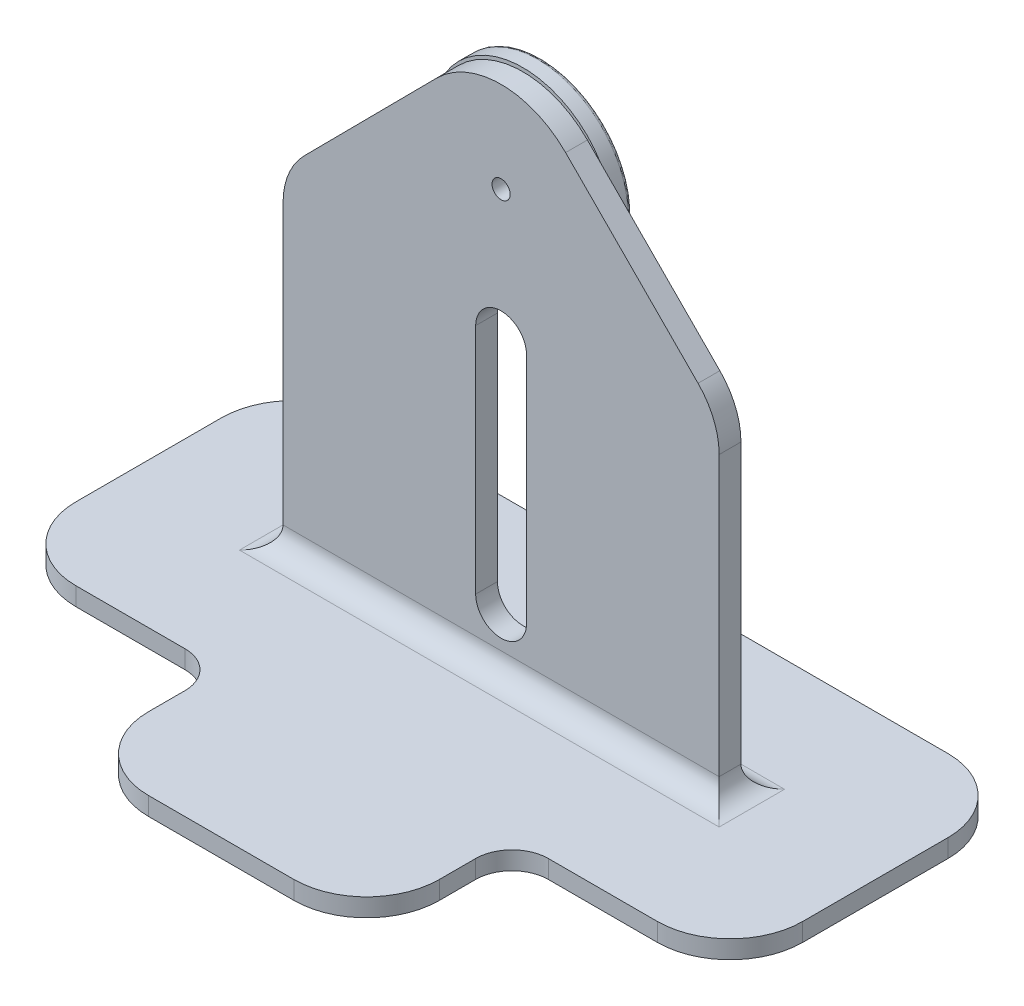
from build123d import *

# Parameters (mm, degrees)
EXTRUSION1_DEPTH        = 2.5
ESQUISSE2_W             = 60
ESQUISSE2_H             = 3
EXTRUSION2_DEPTH        = 75
ESQUISSE3_R             = 1.25
ENL_V_MAT_EXTRU_1_DEPTH = 140.958922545
ENL_V_MAT_EXTRU_2_DEPTH = 140.958922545
CONG_2_R                = 10
ESQUISSE5_R             = 12.5
ESQUISSE5_R_2           = 1.5
EXTRUSION3_DEPTH        = 2.5
CONG_3_R                = 0.5
CONG_4_R                = 3


with BuildPart() as part:
    # Esquisse1 → Extrusion1 (new body)
    with BuildSketch(Plane(origin=(0, 0, 0), x_dir=(1, 0, 0), z_dir=(0, 1, 0))):
        with BuildLine():
            Line((85, 0), (100, 0))
            ThreePointArc((100, 0), (107.071067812, 2.928932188), (110, 10))
            Line((110, 10), (110, 30))
            ThreePointArc((110, 30), (107.071067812, 37.071067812), (100, 40))
            Line((100, 40), (20, 40))
            ThreePointArc((20, 40), (12.928932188, 37.071067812), (10, 30))
            Line((10, 30), (10, 10))
            ThreePointArc((10, 10), (12.928932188, 2.928932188), (20, 0))
            Line((20, 0), (35, 0))
            ThreePointArc((35, 0), (38.535533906, -1.464466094), (40, -5))
            Line((40, -5), (40, -10))
            ThreePointArc((40, -10), (42.928932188, -17.071067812), (50, -20))
            Line((50, -20), (70, -20))
            ThreePointArc((70, -20), (77.071067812, -17.071067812), (80, -10))
            Line((80, -10), (80, -5))
            ThreePointArc((80, -5), (81.464466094, -1.464466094), (85, 0))
        make_face()
    extrude(amount=EXTRUSION1_DEPTH)

    # Esquisse2 → Extrusion2 (add)
    with BuildSketch(Plane(origin=(0, 2.5, 0), x_dir=(-1, 0, 0), z_dir=(0, 1, 0))):
        with Locations((-60, -20)):
            Rectangle(ESQUISSE2_W, ESQUISSE2_H)
    extrude(amount=EXTRUSION2_DEPTH)

    # Esquisse3 → Enl_v. mat.-Extru.1 (cut, through all)
    with BuildSketch(Plane.XY.offset(-18.5)):
        with Locations((60, 60.5)):
            Circle(ESQUISSE3_R)
    extrude(amount=-ENL_V_MAT_EXTRU_1_DEPTH, mode=Mode.SUBTRACT)

    # Esquisse4 → Enl_v. mat.-Extru.2 (cut, through all)
    with BuildSketch(Plane.XY.offset(-18.5)):
        with BuildLine():
            Line((68.875739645, 69.301775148), (90, 48))
            Line((90, 48), (118.521212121, 48))
            Line((118.521212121, 48), (110.278787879, 86.421212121))
            Line((110.278787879, 86.421212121), (5.764848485, 83.289090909))
            Line((5.764848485, 83.289090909), (30, 48))
            Line((30, 48), (51.124260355, 69.301775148))
            ThreePointArc((51.124260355, 69.301775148), (60, 73), (68.875739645, 69.301775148))
        make_face()
        with BuildLine():
            Line((56.5, 42.5), (56.5, 10.5))
            ThreePointArc((56.5, 10.5), (60, 7), (63.5, 10.5))
            Line((63.5, 10.5), (63.5, 42.5))
            ThreePointArc((63.5, 42.5), (60, 46), (56.5, 42.5))
        make_face()
    extrude(amount=-ENL_V_MAT_EXTRU_2_DEPTH, mode=Mode.SUBTRACT)

    # Cong_2
    cong_2_edges = [part.edges().sort_by_distance(p)[0] for p in [
        (90, 48, -20),
        (30, 48, -20),
    ]]
    fillet(cong_2_edges, radius=CONG_2_R)

    # Esquisse5 → Extrusion3 (add)
    with BuildSketch(Plane(origin=(0, 0, -21.5), x_dir=(-1, 0, 0), z_dir=(0, 0, -1))):
        with Locations(Location((-60, 61, 0), (0, 0, 148.870563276))):
            Circle(ESQUISSE5_R)
        with Locations(Location((-60, 61, 0), (0, 0, 218.682187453))):
            Circle(ESQUISSE5_R_2, mode=Mode.SUBTRACT)
    extrude(amount=EXTRUSION3_DEPTH)

    # Cong_3
    cong_3_edges = [part.edges().sort_by_distance(p)[0] for p in [
        (49.299980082, 54.537835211, -24),
    ]]
    fillet(cong_3_edges, radius=CONG_3_R)

    # Cong_4
    cong_4_edges = [part.edges().sort_by_distance(p)[0] for p in [
        (90, 2.5, -20),
        (60, 2.5, -21.5),
        (30, 2.5, -20),
        (60, 2.5, -18.5),
    ]]
    fillet(cong_4_edges, radius=CONG_4_R)


solid = part.part
